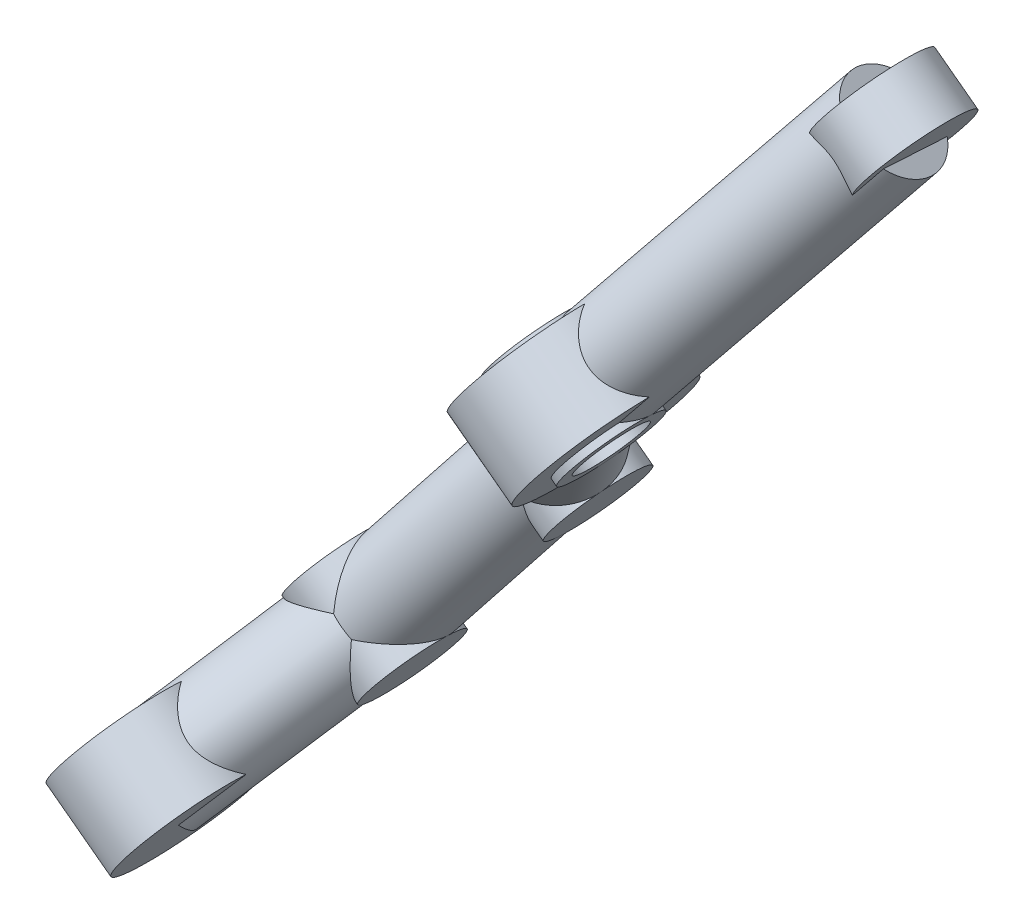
from build123d import *

# Parameters (mm, degrees)
BRAZO_1_PROFILE_R        = 3.5
BRAZO_2_PROFILE_R        = 3.5
BRAZO_3_PROFILE_R        = 3.5
BRAZO_4_PROFILE_R        = 3.5
BRAZO_CODO_1_PROFILE_R   = 3.5
BRAZO_CODO_2_PROFILE_R   = 3.5
BRAZO_CODO_3_PROFILE_R   = 3.5
OJO_PIVOTE_PROFILE_R     = 6
ANCLAJE_CABLE_PROFILE_R  = 4
OJO_ZAPATA_PROFILE_R     = 5
TALADRO_PIVOTE_PROFILE_R = 2.5


with BuildPart() as part:
    # Brazo_1: sweep along a curve in space
    with BuildLine() as brazo_1_path:
        Line((-219.3921140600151, 374.952663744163, -33), (-236.16766000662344, 352.53434404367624, -26))
    # Brazo_1 profile (on start of the path) → Brazo_1 (sweep)
    with BuildSketch(Plane(origin=(-219.3921140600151, 374.952663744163, -33), x_dir=(-0.8006542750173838, 0.5991266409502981, 0), z_dir=(-0.5812382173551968, -0.776748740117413, 0.24253562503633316))):
        Circle(BRAZO_1_PROFILE_R)
    sweep(path=brazo_1_path.line)

    # Brazo_2: sweep along a curve in space
    with BuildLine() as brazo_2_path:
        Line((-236.16766000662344, 352.53434404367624, -26), (-245.1545596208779, 340.52452991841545, -34))
    # Brazo_2 profile (on start of the path) → Brazo_2 (sweep)
    with BuildSketch(Plane(origin=(-236.16766000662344, 352.53434404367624, -26), x_dir=(-0.8006542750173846, 0.5991266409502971, 0), z_dir=(-0.5286411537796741, -0.7064596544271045, -0.4705882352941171))):
        Circle(BRAZO_2_PROFILE_R)
    sweep(path=brazo_2_path.line)

    # Brazo_3: sweep along a curve in space
    with BuildLine() as brazo_3_path:
        Line((-245.1545596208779, 340.52452991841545, -34), (-255.93883915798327, 326.11275296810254, -31))
    # Brazo_3 profile (on start of the path) → Brazo_3 (sweep)
    with BuildSketch(Plane(origin=(-245.1545596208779, 340.52452991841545, -34), x_dir=(-0.8006542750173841, 0.599126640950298, 0), z_dir=(-0.5909748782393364, -0.7897605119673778, 0.16439898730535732))):
        Circle(BRAZO_3_PROFILE_R)
    sweep(path=brazo_3_path.line)

    # Brazo_4: sweep along a curve in space
    with BuildLine() as brazo_4_path:
        Line((-255.93883915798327, 326.11275296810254, -31), (-263.1283588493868, 316.50490166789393, -22))
    # Brazo_4 profile (on start of the path) → Brazo_4 (sweep)
    with BuildSketch(Plane(origin=(-255.93883915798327, 326.11275296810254, -31), x_dir=(0, -0.6836434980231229, -0.729816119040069), z_dir=(-0.4793013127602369, -0.6405234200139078, 0.6000000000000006))):
        Circle(BRAZO_4_PROFILE_R)
    sweep(path=brazo_4_path.line)

    # Brazo_codo_1: sweep along a curve in space
    with BuildLine() as brazo_codo_1_path:
        Line((-233.3653700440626, 350.4374008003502, -26), (-238.96994996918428, 354.6312872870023, -26))
    # Brazo_codo_1 profile (on start of the path) → Brazo_codo_1 (sweep)
    with BuildSketch(Plane(origin=(-233.3653700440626, 350.4374008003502, -26), x_dir=(-0.599126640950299, -0.8006542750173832, 0), z_dir=(-0.8006542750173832, 0.599126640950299, 0))):
        Circle(BRAZO_CODO_1_PROFILE_R)
    sweep(path=brazo_codo_1_path.line)

    # Brazo_codo_2: sweep along a curve in space
    with BuildLine() as brazo_codo_2_path:
        Line((-242.35226965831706, 338.4275866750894, -34), (-247.95684958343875, 342.6214731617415, -34))
    # Brazo_codo_2 profile (on start of the path) → Brazo_codo_2 (sweep)
    with BuildSketch(Plane(origin=(-242.35226965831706, 338.4275866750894, -34), x_dir=(-0.599126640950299, -0.8006542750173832, 0), z_dir=(-0.8006542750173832, 0.599126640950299, 0))):
        Circle(BRAZO_CODO_2_PROFILE_R)
    sweep(path=brazo_codo_2_path.line)

    # Brazo_codo_3: sweep along a curve in space
    with BuildLine() as brazo_codo_3_path:
        Line((-253.13654919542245, 324.0158097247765, -31), (-258.7411291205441, 328.2096962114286, -31))
    # Brazo_codo_3 profile (on start of the path) → Brazo_codo_3 (sweep)
    with BuildSketch(Plane(origin=(-253.13654919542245, 324.0158097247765, -31), x_dir=(-0.5991266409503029, -0.8006542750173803, 0), z_dir=(-0.8006542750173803, 0.5991266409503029, 0))):
        Circle(BRAZO_CODO_3_PROFILE_R)
    sweep(path=brazo_codo_3_path.line)

    # Ojo_pivote: sweep along a curve in space
    with BuildLine() as ojo_pivote_path:
        Line((-233.76569718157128, 350.73696412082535, -26), (-238.5696228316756, 354.33172396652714, -26))
    # Ojo_pivote profile (on start of the path) → Ojo_pivote (sweep)
    with BuildSketch(Plane(origin=(-233.76569718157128, 350.73696412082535, -26), x_dir=(-0.5991266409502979, -0.8006542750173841, 0), z_dir=(-0.8006542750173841, 0.5991266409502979, 0))):
        Circle(OJO_PIVOTE_PROFILE_R)
    sweep(path=ojo_pivote_path.line)

    # Anclaje_cable: sweep along a curve in space
    with BuildLine() as anclaje_cable_path:
        Line((-217.79080550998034, 373.7544104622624, -33), (-220.9934226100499, 376.15091702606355, -33))
    # Anclaje_cable profile (on start of the path) → Anclaje_cable (sweep)
    with BuildSketch(Plane(origin=(-217.79080550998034, 373.7544104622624, -33), x_dir=(-0.5991266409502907, -0.8006542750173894, 0), z_dir=(-0.8006542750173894, 0.5991266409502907, 0))):
        Circle(ANCLAJE_CABLE_PROFILE_R)
    sweep(path=anclaje_cable_path.line)

    # Ojo_zapata: sweep along a curve in space
    with BuildLine() as ojo_zapata_path:
        Line((-260.7263960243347, 314.70752174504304, -22), (-265.530321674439, 318.3022815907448, -22))
    # Ojo_zapata profile (on start of the path) → Ojo_zapata (sweep)
    with BuildSketch(Plane(origin=(-260.7263960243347, 314.70752174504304, -22), x_dir=(-0.5991266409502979, -0.8006542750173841, 0), z_dir=(-0.8006542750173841, 0.5991266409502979, 0))):
        Circle(OJO_ZAPATA_PROFILE_R)
    sweep(path=ojo_zapata_path.line)

    # Taladro_pivote: sweep along a curve in space
    with BuildLine() as taladro_pivote_path:
        Line((-232.9650429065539, 350.13783747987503, -26), (-239.37027710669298, 354.93085060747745, -26))
    # Taladro_pivote profile (on start of the path) → Taladro_pivote (sweep, cut)
    with BuildSketch(Plane(origin=(-232.9650429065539, 350.13783747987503, -26), x_dir=(-0.5991266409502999, -0.8006542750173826, 0), z_dir=(-0.8006542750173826, 0.5991266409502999, 0))):
        Circle(TALADRO_PIVOTE_PROFILE_R)
    sweep(path=taladro_pivote_path.line, mode=Mode.SUBTRACT)


solid = part.part
